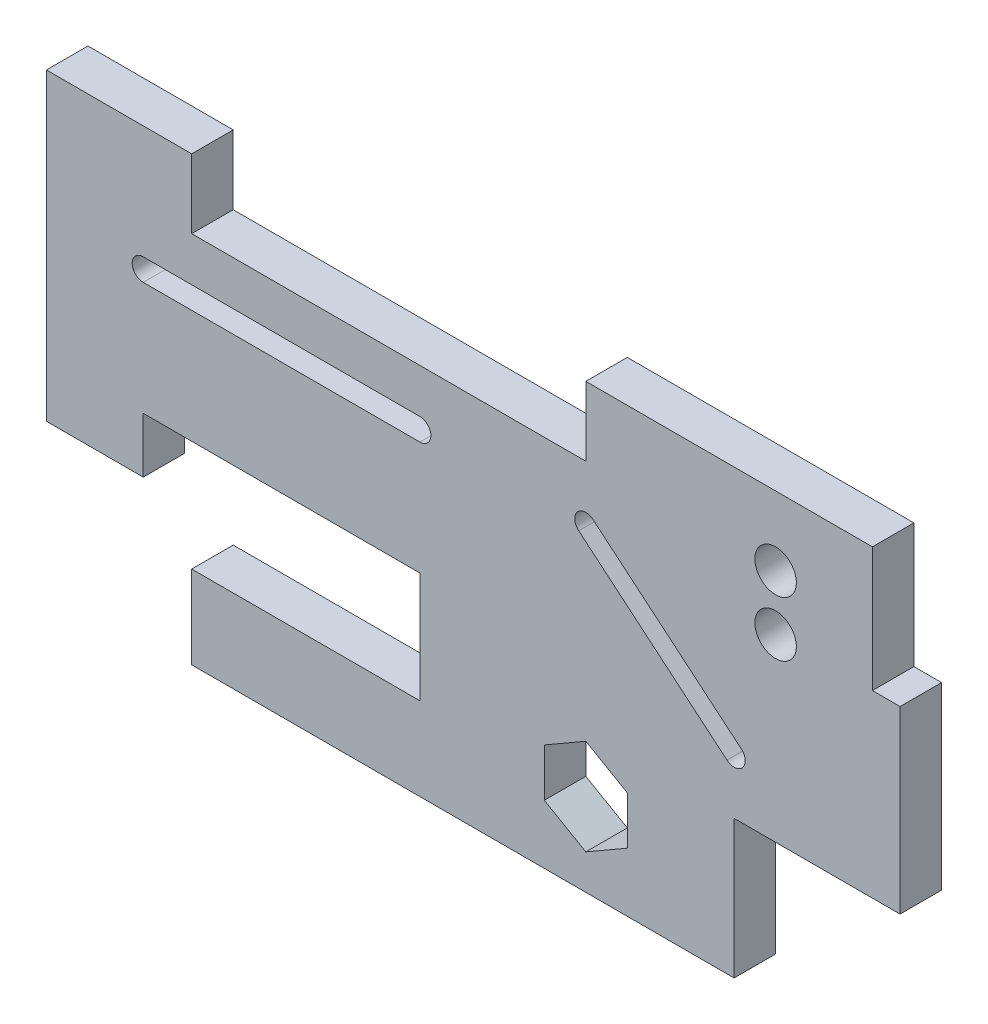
from build123d import *

# Parameters (mm, degrees)
SKETCH1_R           = 4.7625
BOSS_EXTRUDE1_DEPTH = 9.525


with BuildPart() as part:
    # Sketch1 → Boss-Extrude1 (new body)
    with BuildSketch(Plane.XY):
        Polygon((0, 0), (0, 25.4), (-63.5, 25.4), (-63.5, 12.7), (-85.725, 12.7), (-85.725, 82.55), (-52.3748, 82.55), (-52.3748, 66.675), (38.1, 66.675), (38.1, 82.55), (103.898081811, 82.55), (103.898081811, 53.975), (110.248081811, 53.975), (110.248081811, 12.7), (72.148081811, 12.7), (72.148081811, -19.05), (-52.3748, -19.05), (-52.3748, 0), align=None)
        with Locations(Location((81.673081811, 53.975, 0), (0, 0, 180))):
            Circle(SKETCH1_R, mode=Mode.SUBTRACT)
        with Locations(Location((81.673081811, 66.675, 0), (0, 0, 180))):
            Circle(SKETCH1_R, mode=Mode.SUBTRACT)
        Polygon((38.1, 10.998522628), (28.575, 5.499261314), (28.575, -5.499261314), (38.1, -10.998522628), (47.625, -5.499261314), (47.625, 5.499261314), align=None, mode=Mode.SUBTRACT)
        with BuildLine():
            Line((-63.5, 56.515), (0, 56.515))
            ThreePointArc((0, 56.515), (2.54, 53.975), (0, 51.435))
            Line((0, 51.435), (-63.5, 51.435))
            ThreePointArc((-63.5, 51.435), (-66.04, 53.975), (-63.5, 56.515))
        make_face(mode=Mode.SUBTRACT)
        with BuildLine():
            Line((39.732857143, 55.920604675), (73.780938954, 27.345604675))
            ThreePointArc((73.780938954, 27.345604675), (74.093686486, 23.767142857), (70.515224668, 23.454395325))
            Line((70.515224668, 23.454395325), (36.467142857, 52.029395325))
            ThreePointArc((36.467142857, 52.029395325), (36.154395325, 55.607857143), (39.732857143, 55.920604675))
        make_face(mode=Mode.SUBTRACT)
    extrude(amount=BOSS_EXTRUDE1_DEPTH)


solid = part.part
